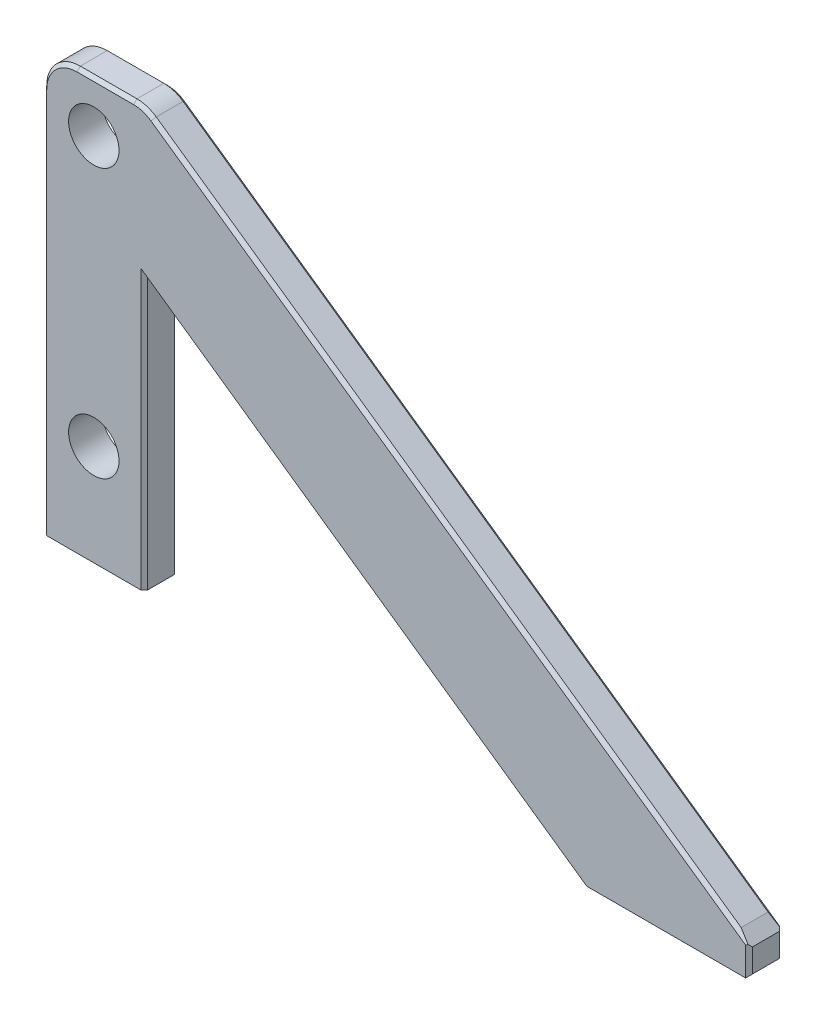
from build123d import *

# Parameters (mm, degrees)
ESQUISSE1_R             = 7.5
EXTRUSION1_DEPTH        = 10
CONG_3_R                = 10
CONG_4_R                = 10
CHANFREIN1_SIZE         = 1
CHANFREIN2_SIZE         = 1
CHANFREIN3_SIZE         = 1
CHANFREIN4_SIZE         = 1
CHANFREIN4_EDGE_2_SIZE  = 1
CHANFREIN4_EDGE_3_SIZE  = 1
CHANFREIN4_EDGE_4_SIZE  = 1
CHANFREIN4_EDGE_4_SIZE2 = 4.07206566


with BuildPart() as part:
    # Esquisse1 → Extrusion1 (new body)
    with BuildSketch(Plane.XY):
        Polygon((-129.94664885, 10), (-159.94664885, 10), (-159.94664885, 135), (-129.94664885, 135), (50, 9), (50, 0), (0, 0), (-129.94664885, 90.98962309), align=None)
        with Locations((-144.94664885, 120)):
            Circle(ESQUISSE1_R, mode=Mode.SUBTRACT)
        with Locations((-144.94664885, 40)):
            Circle(ESQUISSE1_R, mode=Mode.SUBTRACT)
    extrude(amount=EXTRUSION1_DEPTH)

    # Cong_3
    cong_3_edges = [part.edges().sort_by_distance(p)[0] for p in [
        (-159.94664885, 135, 5),
    ]]
    fillet(cong_3_edges, radius=CONG_3_R)

    # Cong_4
    cong_4_edges = [part.edges().sort_by_distance(p)[0] for p in [
        (-129.94664885, 135, 5),
    ]]
    fillet(cong_4_edges, radius=CONG_4_R)

    # Chanfrein1
    chanfrein1_edges = [part.edges().sort_by_distance(p)[0] for p in [
        (-38.681936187, 71.095760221, 10),
        (-129.94664885, 50.494811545, 10),
        (-159.94664885, 67.5, 10),
        (-157.017716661, 132.071067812, 10),
        (-141.523142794, 135, 10),
        (-130.092578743, 134.537169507, 10),
        (-64.973324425, 45.494811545, 10),
    ]]
    chamfer(chanfrein1_edges, length=CHANFREIN1_SIZE)

    # Chanfrein2
    chanfrein2_edges = [part.edges().sort_by_distance(p)[0] for p in [
        (-159.94664885, 67.5, 0),
        (-157.017716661, 132.071067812, 0),
        (-141.523142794, 135, 0),
        (-130.092578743, 134.537169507, 0),
        (-38.681936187, 71.095760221, 0),
    ]]
    chamfer(chanfrein2_edges, length=CHANFREIN2_SIZE)

    # Chanfrein3
    chanfrein3_edges = [part.edges().sort_by_distance(p)[0] for p in [
        (-129.94664885, 50.494811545, 0),
        (-64.973324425, 45.494811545, 0),
    ]]
    chamfer(chanfrein3_edges, length=CHANFREIN3_SIZE)

    # Chanfrein4
    chanfrein4_edges = [part.edges().sort_by_distance(p)[0] for p in [
        (50, 3.889612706, 0),
    ]]
    chamfer(chanfrein4_edges, length=CHANFREIN4_SIZE)

    # Chanfrein4 edge 2
    chanfrein4_edge_2_edges = [part.edges().sort_by_distance(p)[0] for p in [
        (50, 0, 5),
    ]]
    chamfer(chanfrein4_edge_2_edges, length=CHANFREIN4_EDGE_2_SIZE)

    # Chanfrein4 edge 3
    chanfrein4_edge_3_edges = [part.edges().sort_by_distance(p)[0] for p in [
        (50, 3.889612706, 10),
    ]]
    chamfer(chanfrein4_edge_3_edges, length=CHANFREIN4_EDGE_3_SIZE)

    # Chanfrein4 edge 4
    chanfrein4_edge_4_edges = [part.edges().sort_by_distance(p)[0] for p in [
        (50, 9, 5),
    ]]
    chanfrein4_edge_4_side = [part.faces().sort_by_distance(p)[0] for p in [
        (50, 4.44371744, 5),
    ]]
    chamfer(chanfrein4_edge_4_edges, length=CHANFREIN4_EDGE_4_SIZE, length2=CHANFREIN4_EDGE_4_SIZE2, reference=chanfrein4_edge_4_side[0])


solid = part.part
